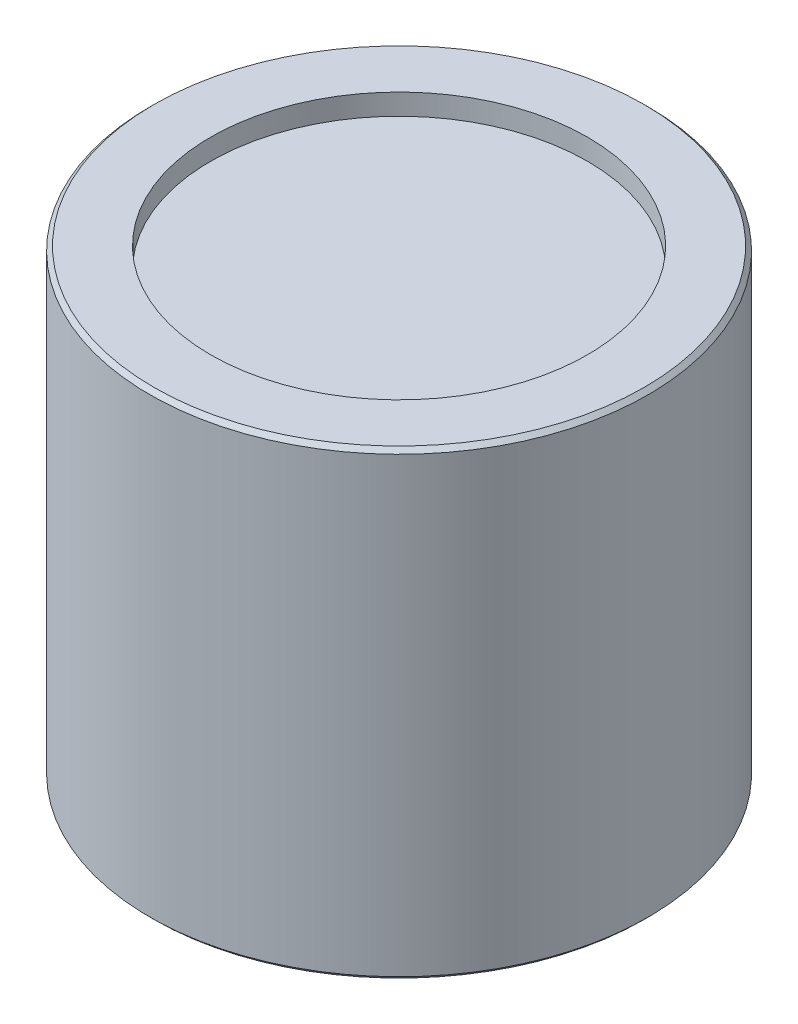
ISO-10303-21;
HEADER;
FILE_DESCRIPTION(('STEP AP214'),'2;1');
FILE_NAME('part.step','',(''),(''),'','','');
FILE_SCHEMA(('AUTOMOTIVE_DESIGN { 1 0 10303 214 1 1 1 1 }'));
ENDSEC;
DATA;
#1=APPLICATION_CONTEXT('core data for automotive mechanical design processes');
#2=APPLICATION_PROTOCOL_DEFINITION('international standard','automotive_design',2000,#1);
#3=PRODUCT_CONTEXT('',#1,'mechanical');
#4=PRODUCT('Part','Part','',(#3));
#5=PRODUCT_RELATED_PRODUCT_CATEGORY('part','',(#4));
#6=PRODUCT_DEFINITION_FORMATION('','',#4);
#7=PRODUCT_DEFINITION_CONTEXT('part definition',#1,'design');
#8=PRODUCT_DEFINITION('design','',#6,#7);
#9=PRODUCT_DEFINITION_SHAPE('','',#8);
#10=(LENGTH_UNIT() NAMED_UNIT(*) SI_UNIT(.MILLI.,.METRE.));
#11=(NAMED_UNIT(*) PLANE_ANGLE_UNIT() SI_UNIT($,.RADIAN.));
#12=(NAMED_UNIT(*) SI_UNIT($,.STERADIAN.) SOLID_ANGLE_UNIT());
#13=UNCERTAINTY_MEASURE_WITH_UNIT(LENGTH_MEASURE(1.E-05),#10,'distance_accuracy_value','');
#14=(GEOMETRIC_REPRESENTATION_CONTEXT(3) GLOBAL_UNCERTAINTY_ASSIGNED_CONTEXT((#13)) GLOBAL_UNIT_ASSIGNED_CONTEXT((#10,
#11,#12)) REPRESENTATION_CONTEXT('',''));
#15=CARTESIAN_POINT('',(0.,0.,0.));
#16=DIRECTION('',(0.,0.,1.));
#17=DIRECTION('',(1.,0.,0.));
#18=AXIS2_PLACEMENT_3D('',#15,#16,#17);
#19=CARTESIAN_POINT('',(0.,7.,0.));
#20=DIRECTION('',(0.,-1.,0.));
#21=DIRECTION('',(0.,0.,-1.));
#22=AXIS2_PLACEMENT_3D('',#19,#20,#21);
#23=CYLINDRICAL_SURFACE('',#22,59.5);
#24=CARTESIAN_POINT('',(0.,7.99999999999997,0.));
#25=DIRECTION('',(0.,-1.,0.));
#26=DIRECTION('',(0.,0.,-1.));
#27=AXIS2_PLACEMENT_3D('',#24,#25,#26);
#28=CIRCLE('',#27,59.5);
#29=CARTESIAN_POINT('',(0.,7.99999999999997,-59.5));
#30=VERTEX_POINT('',#29);
#31=EDGE_CURVE('E44',#30,#30,#28,.F.);
#32=ORIENTED_EDGE('',*,*,#31,.T.);
#33=EDGE_LOOP('',(#32));
#34=FACE_BOUND('',#33,.T.);
#35=CARTESIAN_POINT('',(0.,116.,0.));
#36=DIRECTION('',(0.,-1.,0.));
#37=DIRECTION('',(0.,0.,-1.));
#38=AXIS2_PLACEMENT_3D('',#35,#36,#37);
#39=CIRCLE('',#38,59.5);
#40=CARTESIAN_POINT('',(0.,116.,-59.5));
#41=VERTEX_POINT('',#40);
#42=EDGE_CURVE('E48',#41,#41,#39,.T.);
#43=ORIENTED_EDGE('',*,*,#42,.T.);
#44=EDGE_LOOP('',(#43));
#45=FACE_BOUND('',#44,.T.);
#46=ADVANCED_FACE('F37',(#34,#45),#23,.T.);
#47=CARTESIAN_POINT('',(0.,6.99999999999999,0.));
#48=DIRECTION('',(0.,-1.,0.));
#49=DIRECTION('',(0.,0.,-1.));
#50=AXIS2_PLACEMENT_3D('',#47,#48,#49);
#51=PLANE('',#50);
#52=CARTESIAN_POINT('',(0.,6.99999999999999,0.));
#53=DIRECTION('',(0.,-1.,0.));
#54=DIRECTION('',(0.,0.,-1.));
#55=AXIS2_PLACEMENT_3D('',#52,#53,#54);
#56=CIRCLE('',#55,58.5);
#57=CARTESIAN_POINT('',(0.,6.99999999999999,-58.5));
#58=VERTEX_POINT('',#57);
#59=EDGE_CURVE('E52',#58,#58,#56,.T.);
#60=ORIENTED_EDGE('',*,*,#59,.T.);
#61=EDGE_LOOP('',(#60));
#62=FACE_BOUND('',#61,.T.);
#63=CARTESIAN_POINT('',(0.,6.99999999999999,0.));
#64=DIRECTION('',(0.,-1.,0.));
#65=DIRECTION('',(0.,0.,-1.));
#66=AXIS2_PLACEMENT_3D('',#63,#64,#65);
#67=CIRCLE('',#66,45.);
#68=CARTESIAN_POINT('',(0.,6.99999999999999,-45.));
#69=VERTEX_POINT('',#68);
#70=EDGE_CURVE('E57',#69,#69,#67,.T.);
#71=ORIENTED_EDGE('',*,*,#70,.F.);
#72=EDGE_LOOP('',(#71));
#73=FACE_BOUND('',#72,.T.);
#74=ADVANCED_FACE('F92',(#62,#73),#51,.T.);
#75=CARTESIAN_POINT('',(0.,7.,0.));
#76=DIRECTION('',(0.,-1.,0.));
#77=DIRECTION('',(0.,0.,-1.));
#78=AXIS2_PLACEMENT_3D('',#75,#76,#77);
#79=CYLINDRICAL_SURFACE('',#78,45.);
#80=ORIENTED_EDGE('',*,*,#70,.T.);
#81=EDGE_LOOP('',(#80));
#82=FACE_BOUND('',#81,.T.);
#83=CARTESIAN_POINT('',(0.,0.,0.));
#84=DIRECTION('',(0.,-1.,0.));
#85=DIRECTION('',(0.,0.,-1.));
#86=AXIS2_PLACEMENT_3D('',#83,#84,#85);
#87=CIRCLE('',#86,45.);
#88=CARTESIAN_POINT('',(0.,0.,-45.));
#89=VERTEX_POINT('',#88);
#90=EDGE_CURVE('E60',#89,#89,#87,.T.);
#91=ORIENTED_EDGE('',*,*,#90,.F.);
#92=EDGE_LOOP('',(#91));
#93=FACE_BOUND('',#92,.T.);
#94=ADVANCED_FACE('F88',(#82,#93),#79,.T.);
#95=CARTESIAN_POINT('',(0.,0.,0.));
#96=DIRECTION('',(0.,-1.,0.));
#97=DIRECTION('',(0.,0.,-1.));
#98=AXIS2_PLACEMENT_3D('',#95,#96,#97);
#99=PLANE('',#98);
#100=ORIENTED_EDGE('',*,*,#90,.T.);
#101=EDGE_LOOP('',(#100));
#102=FACE_BOUND('',#101,.T.);
#103=ADVANCED_FACE('F81',(#102),#99,.T.);
#104=CARTESIAN_POINT('',(0.,117.,0.));
#105=DIRECTION('',(0.,-1.,0.));
#106=DIRECTION('',(0.,0.,-1.));
#107=AXIS2_PLACEMENT_3D('',#104,#105,#106);
#108=PLANE('',#107);
#109=CARTESIAN_POINT('',(0.,117.,0.));
#110=DIRECTION('',(0.,1.,0.));
#111=DIRECTION('',(0.,0.,1.));
#112=AXIS2_PLACEMENT_3D('',#109,#110,#111);
#113=CIRCLE('',#112,45.);
#114=CARTESIAN_POINT('',(0.,117.,45.));
#115=VERTEX_POINT('',#114);
#116=EDGE_CURVE('E64',#115,#115,#113,.T.);
#117=ORIENTED_EDGE('',*,*,#116,.F.);
#118=EDGE_LOOP('',(#117));
#119=FACE_BOUND('',#118,.T.);
#120=CARTESIAN_POINT('',(0.,117.,0.));
#121=DIRECTION('',(0.,-1.,0.));
#122=DIRECTION('',(0.,0.,-1.));
#123=AXIS2_PLACEMENT_3D('',#120,#121,#122);
#124=CIRCLE('',#123,58.5);
#125=CARTESIAN_POINT('',(0.,117.,-58.5));
#126=VERTEX_POINT('',#125);
#127=EDGE_CURVE('E10',#126,#126,#124,.F.);
#128=ORIENTED_EDGE('',*,*,#127,.T.);
#129=EDGE_LOOP('',(#128));
#130=FACE_BOUND('',#129,.T.);
#131=ADVANCED_FACE('F78',(#119,#130),#108,.F.);
#132=CARTESIAN_POINT('',(0.,6.99999999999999,0.));
#133=DIRECTION('',(0.,1.,0.));
#134=DIRECTION('',(0.,0.,1.));
#135=AXIS2_PLACEMENT_3D('',#132,#133,#134);
#136=CONICAL_SURFACE('',#135,58.5,0.785398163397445);
#137=ORIENTED_EDGE('',*,*,#31,.F.);
#138=EDGE_LOOP('',(#137));
#139=FACE_BOUND('',#138,.T.);
#140=ORIENTED_EDGE('',*,*,#59,.F.);
#141=EDGE_LOOP('',(#140));
#142=FACE_BOUND('',#141,.T.);
#143=ADVANCED_FACE('F80',(#139,#142),#136,.T.);
#144=CARTESIAN_POINT('',(0.,116.,0.));
#145=DIRECTION('',(0.,-1.,0.));
#146=DIRECTION('',(0.,0.,-1.));
#147=AXIS2_PLACEMENT_3D('',#144,#145,#146);
#148=CONICAL_SURFACE('',#147,59.5,0.785398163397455);
#149=ORIENTED_EDGE('',*,*,#127,.F.);
#150=EDGE_LOOP('',(#149));
#151=FACE_BOUND('',#150,.T.);
#152=ORIENTED_EDGE('',*,*,#42,.F.);
#153=EDGE_LOOP('',(#152));
#154=FACE_BOUND('',#153,.T.);
#155=ADVANCED_FACE('F39',(#151,#154),#148,.T.);
#156=CARTESIAN_POINT('',(0.,112.,0.));
#157=DIRECTION('',(0.,1.,0.));
#158=DIRECTION('',(0.,0.,1.));
#159=AXIS2_PLACEMENT_3D('',#156,#157,#158);
#160=CYLINDRICAL_SURFACE('',#159,45.);
#161=CARTESIAN_POINT('',(0.,112.,0.));
#162=DIRECTION('',(0.,1.,0.));
#163=DIRECTION('',(0.,0.,1.));
#164=AXIS2_PLACEMENT_3D('',#161,#162,#163);
#165=CIRCLE('',#164,45.);
#166=CARTESIAN_POINT('',(0.,112.,45.));
#167=VERTEX_POINT('',#166);
#168=EDGE_CURVE('E63',#167,#167,#165,.T.);
#169=ORIENTED_EDGE('',*,*,#168,.F.);
#170=EDGE_LOOP('',(#169));
#171=FACE_BOUND('',#170,.T.);
#172=ORIENTED_EDGE('',*,*,#116,.T.);
#173=EDGE_LOOP('',(#172));
#174=FACE_BOUND('',#173,.T.);
#175=ADVANCED_FACE('F72',(#171,#174),#160,.F.);
#176=CARTESIAN_POINT('',(0.,112.,0.));
#177=DIRECTION('',(0.,1.,0.));
#178=DIRECTION('',(0.,0.,1.));
#179=AXIS2_PLACEMENT_3D('',#176,#177,#178);
#180=PLANE('',#179);
#181=ORIENTED_EDGE('',*,*,#168,.T.);
#182=EDGE_LOOP('',(#181));
#183=FACE_BOUND('',#182,.T.);
#184=ADVANCED_FACE('F70',(#183),#180,.T.);
#185=CLOSED_SHELL('',(#46,#74,#94,#103,#131,#143,#155,#175,#184));
#186=MANIFOLD_SOLID_BREP('B2',#185);
#187=ADVANCED_BREP_SHAPE_REPRESENTATION('',(#18,#186),#14);
#188=SHAPE_DEFINITION_REPRESENTATION(#9,#187);
ENDSEC;
END-ISO-10303-21;
